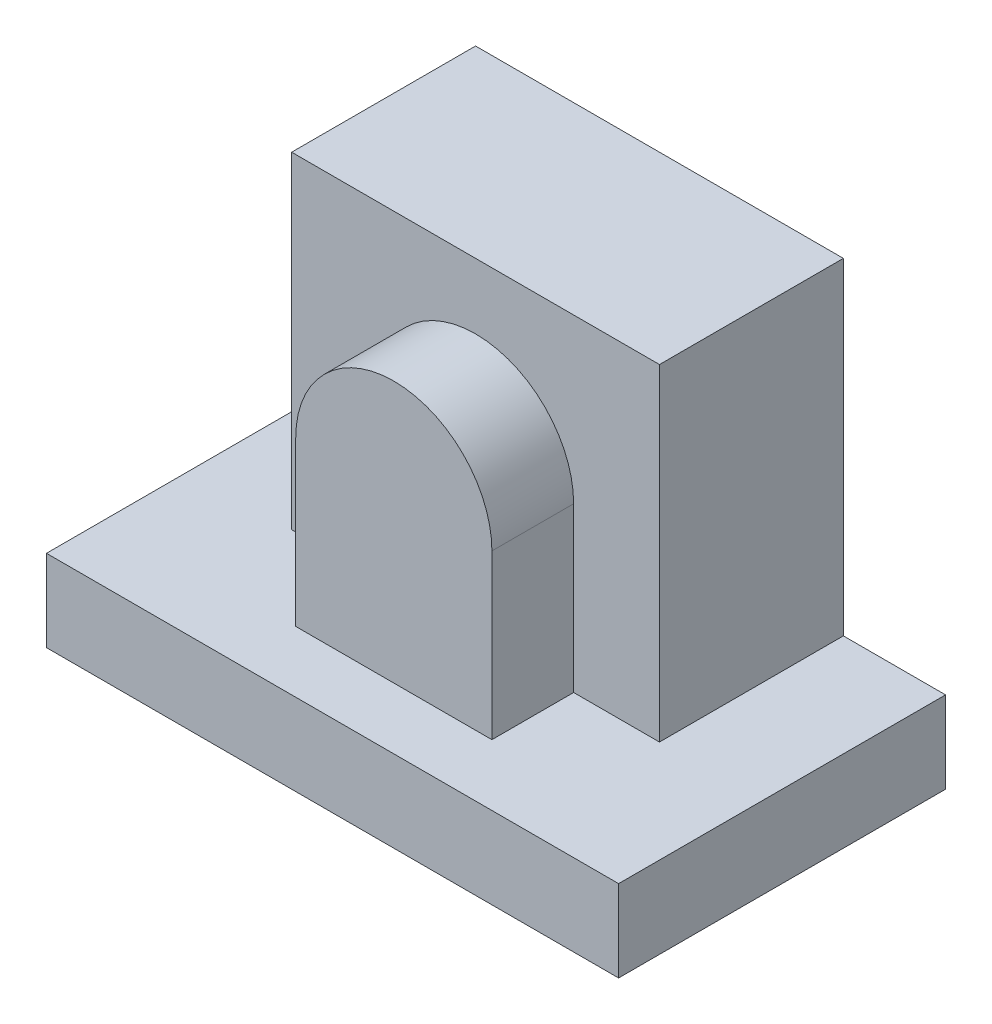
from build123d import *

# Parameters (mm, degrees)
SKETCH_1_W      = 140
SKETCH_1_H      = 80
EXTRUDE_1_DEPTH = 20
SKETCH_2_W      = 90
SKETCH_2_H      = 45
EXTRUDE_2_DEPTH = 80
EXTRUDE_3_DEPTH = 20


with BuildPart() as part:
    # Sketch 1 → Extrude 1 (new body)
    with BuildSketch(Plane(origin=(0, 0, 0), x_dir=(1, 0, 0), z_dir=(0, 1, 0))):
        with Locations((0, -40)):
            Rectangle(SKETCH_1_W, SKETCH_1_H)
    extrude(amount=EXTRUDE_1_DEPTH)

    # Sketch 2 → Extrude 2 (add)
    with BuildSketch(Plane(origin=(0, 20, 0), x_dir=(1, 0, 0), z_dir=(0, 1, 0))):
        with Locations((0, -22.5)):
            Rectangle(SKETCH_2_W, SKETCH_2_H)
    extrude(amount=EXTRUDE_2_DEPTH)

    # Sketch 3 → Extrude 3 (add)
    with BuildSketch(Plane.XY.offset(45)):
        with BuildLine():
            Line((24, 20), (-24, 20))
            Line((-24, 20), (-24, 60))
            ThreePointArc((-24, 60), (0, 84), (24, 60))
            Line((24, 60), (24, 20))
        make_face()
    extrude(amount=EXTRUDE_3_DEPTH)


solid = part.part
